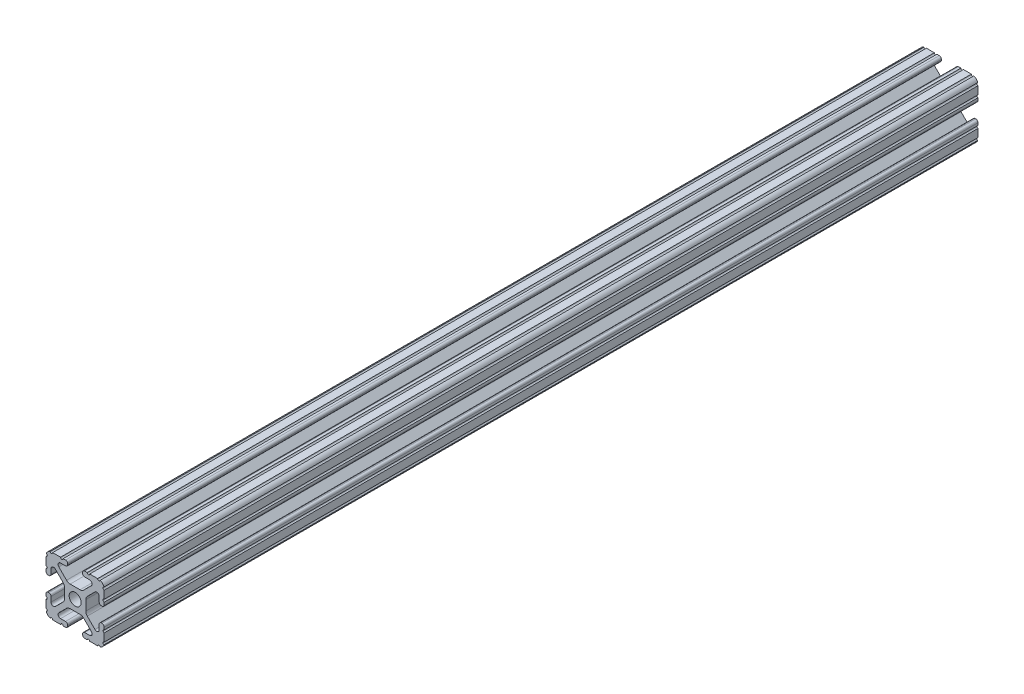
from build123d import *

# Parameters (mm, degrees)
BOSS_EXTRUDE1_DEPTH     = 190.5
CUT_EXTRUDE1_DEPTH      = 192.344793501
CUT_EXTRUDE1_DEPTH_BACK = 192.344793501
SKETCH5_R               = 0.55245


with BuildPart() as part:
    # Sketch4 → Boss-Extrude1 (new, symmetric)
    with BuildSketch(Plane.XY):
        with BuildLine():
            Line((4.190365, -12.7), (10.11729625, -12.7))
            ThreePointArc((10.11729625, -12.7), (11.943543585, -11.943543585), (12.7, -10.11729625))
            Line((12.7, -10.11729625), (12.7, -4.190365))
            ThreePointArc((12.7, -4.190365), (12.42492494, -3.52627506), (11.760835, -3.2512))
            Line((11.760835, -3.2512), (11.429365, -3.2512))
            ThreePointArc((11.429365, -3.2512), (10.76527506, -3.52627506), (10.4902, -4.190365))
            Line((10.4902, -4.190365), (10.4902, -6.348478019))
            ThreePointArc((10.4902, -6.348478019), (9.830707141, -7.335478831), (8.666460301, -7.103895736))
            Line((8.666460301, -7.103895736), (5.299899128, -3.737334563))
            ThreePointArc((5.299899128, -3.737334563), (4.817571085, -3.015479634), (4.6482, -2.16399369))
            Line((4.6482, -2.16399369), (4.6482, 0))
            Line((4.6482, 0), (2.6035, 0))
            ThreePointArc((2.6035, 0), (1.840952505, -1.840952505), (0, -2.6035))
            Line((0, -2.6035), (0, -4.6482))
            Line((0, -4.6482), (2.16399369, -4.6482))
            ThreePointArc((2.16399369, -4.6482), (3.015479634, -4.817571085), (3.737334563, -5.299899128))
            Line((3.737334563, -5.299899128), (7.103895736, -8.666460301))
            ThreePointArc((7.103895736, -8.666460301), (7.335478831, -9.830707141), (6.348478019, -10.4902))
            Line((6.348478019, -10.4902), (4.190365, -10.4902))
            ThreePointArc((4.190365, -10.4902), (3.52627506, -10.76527506), (3.2512, -11.429365))
            Line((3.2512, -11.429365), (3.2512, -11.760835))
            ThreePointArc((3.2512, -11.760835), (3.52627506, -12.42492494), (4.190365, -12.7))
        make_face()
    extrude(amount=BOSS_EXTRUDE1_DEPTH, both=True)

    # Sketch5 → Cut-Extrude1 (cut, two sides: drawn at the far end of the back side and taken through both)
    with BuildSketch(Plane.XY.offset(-CUT_EXTRUDE1_DEPTH_BACK)):
        with Locations((10.356153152, -12.7)):
            Circle(SKETCH5_R)
        with Locations((5.796028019, -12.7)):
            Circle(SKETCH5_R)
        with Locations((12.7, -10.356153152)):
            Circle(SKETCH5_R)
        with Locations((12.7, -5.796028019)):
            Circle(SKETCH5_R)
    extrude(amount=CUT_EXTRUDE1_DEPTH + CUT_EXTRUDE1_DEPTH_BACK, mode=Mode.SUBTRACT)

    # Mirror1: part across plane


with BuildPart() as part_1:
    add(part.part)
    add(part.part.mirror(Plane(origin=(0, 0, 0), x_dir=(0, 0, 1), z_dir=(1, 0, 0))))

    # Mirror2: part across plane


with BuildPart() as part_2:
    add(part_1.part)
    add(part_1.part.mirror(Plane.ZX))


solid = part_2.part
